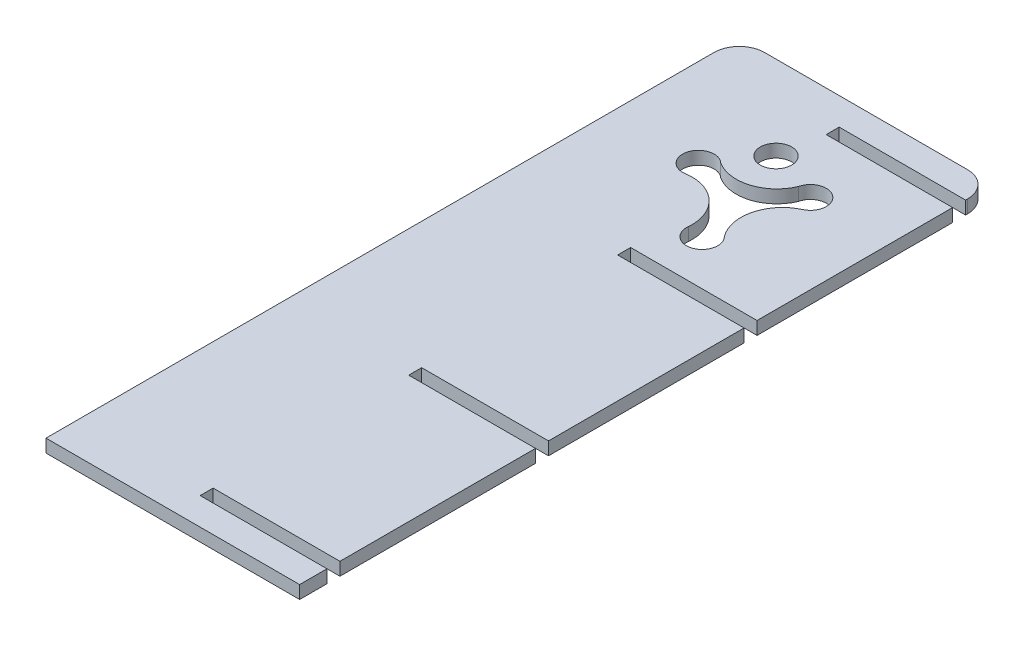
ISO-10303-21;
HEADER;
FILE_DESCRIPTION(('STEP AP214'),'2;1');
FILE_NAME('part.step','',(''),(''),'','','');
FILE_SCHEMA(('AUTOMOTIVE_DESIGN { 1 0 10303 214 1 1 1 1 }'));
ENDSEC;
DATA;
#1=APPLICATION_CONTEXT('core data for automotive mechanical design processes');
#2=APPLICATION_PROTOCOL_DEFINITION('international standard','automotive_design',2000,#1);
#3=PRODUCT_CONTEXT('',#1,'mechanical');
#4=PRODUCT('Part','Part','',(#3));
#5=PRODUCT_RELATED_PRODUCT_CATEGORY('part','',(#4));
#6=PRODUCT_DEFINITION_FORMATION('','',#4);
#7=PRODUCT_DEFINITION_CONTEXT('part definition',#1,'design');
#8=PRODUCT_DEFINITION('design','',#6,#7);
#9=PRODUCT_DEFINITION_SHAPE('','',#8);
#10=(LENGTH_UNIT() NAMED_UNIT(*) SI_UNIT(.MILLI.,.METRE.));
#11=(NAMED_UNIT(*) PLANE_ANGLE_UNIT() SI_UNIT($,.RADIAN.));
#12=(NAMED_UNIT(*) SI_UNIT($,.STERADIAN.) SOLID_ANGLE_UNIT());
#13=UNCERTAINTY_MEASURE_WITH_UNIT(LENGTH_MEASURE(1.E-05),#10,'distance_accuracy_value','');
#14=(GEOMETRIC_REPRESENTATION_CONTEXT(3) GLOBAL_UNCERTAINTY_ASSIGNED_CONTEXT((#13)) GLOBAL_UNIT_ASSIGNED_CONTEXT((#10,
#11,#12)) REPRESENTATION_CONTEXT('',''));
#15=CARTESIAN_POINT('',(0.,0.,0.));
#16=DIRECTION('',(0.,0.,1.));
#17=DIRECTION('',(1.,0.,0.));
#18=AXIS2_PLACEMENT_3D('',#15,#16,#17);
#19=CARTESIAN_POINT('',(0.,23.,-799.229373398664));
#20=DIRECTION('',(0.,0.,1.));
#21=DIRECTION('',(1.,0.,0.));
#22=AXIS2_PLACEMENT_3D('',#19,#20,#21);
#23=PLANE('',#22);
#24=DIRECTION('',(-1.,0.,0.));
#25=VECTOR('',#24,1.);
#26=CARTESIAN_POINT('',(0.,0.,-799.229373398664));
#27=LINE('',#26,#25);
#28=CARTESIAN_POINT('',(348.013954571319,0.,-799.229373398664));
#29=VERTEX_POINT('',#28);
#30=CARTESIAN_POINT('',(-11.986045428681,0.,-799.229373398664));
#31=VERTEX_POINT('',#30);
#32=EDGE_CURVE('E275',#29,#31,#27,.T.);
#33=ORIENTED_EDGE('',*,*,#32,.T.);
#34=DIRECTION('',(0.,-1.,0.));
#35=VECTOR('',#34,1.);
#36=CARTESIAN_POINT('',(-11.986045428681,23.,-799.229373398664));
#37=LINE('',#36,#35);
#38=CARTESIAN_POINT('',(-11.986045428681,23.,-799.229373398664));
#39=VERTEX_POINT('',#38);
#40=EDGE_CURVE('E11',#39,#31,#37,.T.);
#41=ORIENTED_EDGE('',*,*,#40,.F.);
#42=DIRECTION('',(-1.,0.,0.));
#43=VECTOR('',#42,1.);
#44=CARTESIAN_POINT('',(0.,23.,-799.229373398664));
#45=LINE('',#44,#43);
#46=CARTESIAN_POINT('',(348.013954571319,23.,-799.229373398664));
#47=VERTEX_POINT('',#46);
#48=EDGE_CURVE('E417',#47,#39,#45,.T.);
#49=ORIENTED_EDGE('',*,*,#48,.F.);
#50=DIRECTION('',(0.,-1.,0.));
#51=VECTOR('',#50,1.);
#52=CARTESIAN_POINT('',(348.013954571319,23.,-799.229373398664));
#53=LINE('',#52,#51);
#54=EDGE_CURVE('E318',#47,#29,#53,.T.);
#55=ORIENTED_EDGE('',*,*,#54,.T.);
#56=EDGE_LOOP('',(#33,#41,#49,#55));
#57=FACE_BOUND('',#56,.T.);
#58=ADVANCED_FACE('F34',(#57),#23,.F.);
#59=CARTESIAN_POINT('',(-11.9860454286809,23.,-754.229373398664));
#60=DIRECTION('',(0.,-1.,0.));
#61=DIRECTION('',(0.,0.,-1.));
#62=AXIS2_PLACEMENT_3D('',#59,#60,#61);
#63=CYLINDRICAL_SURFACE('',#62,44.9999999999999);
#64=CARTESIAN_POINT('',(-11.9860454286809,0.,-754.229373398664));
#65=DIRECTION('',(0.,1.,0.));
#66=DIRECTION('',(0.,0.,1.));
#67=AXIS2_PLACEMENT_3D('',#64,#65,#66);
#68=CIRCLE('',#67,44.9999999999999);
#69=CARTESIAN_POINT('',(-56.986045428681,0.,-754.229373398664));
#70=VERTEX_POINT('',#69);
#71=EDGE_CURVE('E278',#31,#70,#68,.T.);
#72=ORIENTED_EDGE('',*,*,#71,.T.);
#73=DIRECTION('',(0.,-1.,0.));
#74=VECTOR('',#73,1.);
#75=CARTESIAN_POINT('',(-56.986045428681,23.,-754.229373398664));
#76=LINE('',#75,#74);
#77=CARTESIAN_POINT('',(-56.986045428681,23.,-754.229373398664));
#78=VERTEX_POINT('',#77);
#79=EDGE_CURVE('E44',#78,#70,#76,.T.);
#80=ORIENTED_EDGE('',*,*,#79,.F.);
#81=CARTESIAN_POINT('',(-11.9860454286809,23.,-754.229373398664));
#82=DIRECTION('',(0.,1.,0.));
#83=DIRECTION('',(0.,0.,1.));
#84=AXIS2_PLACEMENT_3D('',#81,#82,#83);
#85=CIRCLE('',#84,44.9999999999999);
#86=EDGE_CURVE('E419',#39,#78,#85,.T.);
#87=ORIENTED_EDGE('',*,*,#86,.F.);
#88=ORIENTED_EDGE('',*,*,#40,.T.);
#89=EDGE_LOOP('',(#72,#80,#87,#88));
#90=FACE_BOUND('',#89,.T.);
#91=ADVANCED_FACE('F483',(#90),#63,.T.);
#92=CARTESIAN_POINT('',(-56.9860454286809,23.,0.));
#93=DIRECTION('',(1.,0.,0.));
#94=DIRECTION('',(0.,0.,-1.));
#95=AXIS2_PLACEMENT_3D('',#92,#93,#94);
#96=PLANE('',#95);
#97=DIRECTION('',(0.,0.,1.));
#98=VECTOR('',#97,1.);
#99=CARTESIAN_POINT('',(-56.9860454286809,0.,0.));
#100=LINE('',#99,#98);
#101=CARTESIAN_POINT('',(-56.9860454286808,0.,430.770626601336));
#102=VERTEX_POINT('',#101);
#103=EDGE_CURVE('E280',#70,#102,#100,.T.);
#104=ORIENTED_EDGE('',*,*,#103,.T.);
#105=DIRECTION('',(0.,-1.,0.));
#106=VECTOR('',#105,1.);
#107=CARTESIAN_POINT('',(-56.9860454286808,23.,430.770626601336));
#108=LINE('',#107,#106);
#109=CARTESIAN_POINT('',(-56.9860454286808,23.,430.770626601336));
#110=VERTEX_POINT('',#109);
#111=EDGE_CURVE('E367',#110,#102,#108,.T.);
#112=ORIENTED_EDGE('',*,*,#111,.F.);
#113=DIRECTION('',(0.,0.,1.));
#114=VECTOR('',#113,1.);
#115=CARTESIAN_POINT('',(-56.9860454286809,23.,0.));
#116=LINE('',#115,#114);
#117=EDGE_CURVE('E421',#78,#110,#116,.T.);
#118=ORIENTED_EDGE('',*,*,#117,.F.);
#119=ORIENTED_EDGE('',*,*,#79,.T.);
#120=EDGE_LOOP('',(#104,#112,#118,#119));
#121=FACE_BOUND('',#120,.T.);
#122=ADVANCED_FACE('F488',(#121),#96,.F.);
#123=CARTESIAN_POINT('',(0.,23.,430.770626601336));
#124=DIRECTION('',(0.,0.,-1.));
#125=DIRECTION('',(-1.,0.,0.));
#126=AXIS2_PLACEMENT_3D('',#123,#124,#125);
#127=PLANE('',#126);
#128=DIRECTION('',(1.,0.,0.));
#129=VECTOR('',#128,1.);
#130=CARTESIAN_POINT('',(0.,0.,430.770626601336));
#131=LINE('',#130,#129);
#132=CARTESIAN_POINT('',(393.013954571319,0.,430.770626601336));
#133=VERTEX_POINT('',#132);
#134=EDGE_CURVE('E282',#102,#133,#131,.T.);
#135=ORIENTED_EDGE('',*,*,#134,.T.);
#136=DIRECTION('',(0.,-1.,0.));
#137=VECTOR('',#136,1.);
#138=CARTESIAN_POINT('',(393.013954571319,23.,430.770626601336));
#139=LINE('',#138,#137);
#140=CARTESIAN_POINT('',(393.013954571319,23.,430.770626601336));
#141=VERTEX_POINT('',#140);
#142=EDGE_CURVE('E364',#141,#133,#139,.T.);
#143=ORIENTED_EDGE('',*,*,#142,.F.);
#144=DIRECTION('',(1.,0.,0.));
#145=VECTOR('',#144,1.);
#146=CARTESIAN_POINT('',(0.,23.,430.770626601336));
#147=LINE('',#146,#145);
#148=EDGE_CURVE('E423',#110,#141,#147,.T.);
#149=ORIENTED_EDGE('',*,*,#148,.F.);
#150=ORIENTED_EDGE('',*,*,#111,.T.);
#151=EDGE_LOOP('',(#135,#143,#149,#150));
#152=FACE_BOUND('',#151,.T.);
#153=ADVANCED_FACE('F570',(#152),#127,.F.);
#154=CARTESIAN_POINT('',(393.013954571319,23.,0.));
#155=DIRECTION('',(-1.,0.,0.));
#156=DIRECTION('',(0.,0.,1.));
#157=AXIS2_PLACEMENT_3D('',#154,#155,#156);
#158=PLANE('',#157);
#159=DIRECTION('',(0.,0.,-1.));
#160=VECTOR('',#159,1.);
#161=CARTESIAN_POINT('',(393.013954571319,0.,0.));
#162=LINE('',#161,#160);
#163=CARTESIAN_POINT('',(393.013954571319,0.,382.270626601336));
#164=VERTEX_POINT('',#163);
#165=EDGE_CURVE('E284',#133,#164,#162,.T.);
#166=ORIENTED_EDGE('',*,*,#165,.T.);
#167=DIRECTION('',(0.,-1.,0.));
#168=VECTOR('',#167,1.);
#169=CARTESIAN_POINT('',(393.013954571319,23.,382.270626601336));
#170=LINE('',#169,#168);
#171=CARTESIAN_POINT('',(393.013954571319,23.,382.270626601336));
#172=VERTEX_POINT('',#171);
#173=EDGE_CURVE('E361',#172,#164,#170,.T.);
#174=ORIENTED_EDGE('',*,*,#173,.F.);
#175=DIRECTION('',(0.,0.,-1.));
#176=VECTOR('',#175,1.);
#177=CARTESIAN_POINT('',(393.013954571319,23.,0.));
#178=LINE('',#177,#176);
#179=EDGE_CURVE('E425',#141,#172,#178,.T.);
#180=ORIENTED_EDGE('',*,*,#179,.F.);
#181=ORIENTED_EDGE('',*,*,#142,.T.);
#182=EDGE_LOOP('',(#166,#174,#180,#181));
#183=FACE_BOUND('',#182,.T.);
#184=ADVANCED_FACE('F566',(#183),#158,.F.);
#185=CARTESIAN_POINT('',(0.,23.,382.270626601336));
#186=DIRECTION('',(0.,0.,1.));
#187=DIRECTION('',(1.,0.,0.));
#188=AXIS2_PLACEMENT_3D('',#185,#186,#187);
#189=PLANE('',#188);
#190=DIRECTION('',(-1.,0.,0.));
#191=VECTOR('',#190,1.);
#192=CARTESIAN_POINT('',(0.,0.,382.270626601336));
#193=LINE('',#192,#191);
#194=CARTESIAN_POINT('',(168.013954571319,0.,382.270626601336));
#195=VERTEX_POINT('',#194);
#196=EDGE_CURVE('E286',#164,#195,#193,.T.);
#197=ORIENTED_EDGE('',*,*,#196,.T.);
#198=DIRECTION('',(0.,-1.,0.));
#199=VECTOR('',#198,1.);
#200=CARTESIAN_POINT('',(168.013954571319,23.,382.270626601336));
#201=LINE('',#200,#199);
#202=CARTESIAN_POINT('',(168.013954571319,23.,382.270626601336));
#203=VERTEX_POINT('',#202);
#204=EDGE_CURVE('E358',#203,#195,#201,.T.);
#205=ORIENTED_EDGE('',*,*,#204,.F.);
#206=DIRECTION('',(-1.,0.,0.));
#207=VECTOR('',#206,1.);
#208=CARTESIAN_POINT('',(0.,23.,382.270626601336));
#209=LINE('',#208,#207);
#210=EDGE_CURVE('E427',#172,#203,#209,.T.);
#211=ORIENTED_EDGE('',*,*,#210,.F.);
#212=ORIENTED_EDGE('',*,*,#173,.T.);
#213=EDGE_LOOP('',(#197,#205,#211,#212));
#214=FACE_BOUND('',#213,.T.);
#215=ADVANCED_FACE('F562',(#214),#189,.F.);
#216=CARTESIAN_POINT('',(168.013954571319,23.,0.));
#217=DIRECTION('',(-1.,0.,0.));
#218=DIRECTION('',(0.,0.,1.));
#219=AXIS2_PLACEMENT_3D('',#216,#217,#218);
#220=PLANE('',#219);
#221=DIRECTION('',(0.,0.,-1.));
#222=VECTOR('',#221,1.);
#223=CARTESIAN_POINT('',(168.013954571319,0.,0.));
#224=LINE('',#223,#222);
#225=CARTESIAN_POINT('',(168.013954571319,0.,359.270626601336));
#226=VERTEX_POINT('',#225);
#227=EDGE_CURVE('E288',#195,#226,#224,.T.);
#228=ORIENTED_EDGE('',*,*,#227,.T.);
#229=DIRECTION('',(0.,-1.,0.));
#230=VECTOR('',#229,1.);
#231=CARTESIAN_POINT('',(168.013954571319,23.,359.270626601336));
#232=LINE('',#231,#230);
#233=CARTESIAN_POINT('',(168.013954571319,23.,359.270626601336));
#234=VERTEX_POINT('',#233);
#235=EDGE_CURVE('E355',#234,#226,#232,.T.);
#236=ORIENTED_EDGE('',*,*,#235,.F.);
#237=DIRECTION('',(0.,0.,-1.));
#238=VECTOR('',#237,1.);
#239=CARTESIAN_POINT('',(168.013954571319,23.,0.));
#240=LINE('',#239,#238);
#241=EDGE_CURVE('E429',#203,#234,#240,.T.);
#242=ORIENTED_EDGE('',*,*,#241,.F.);
#243=ORIENTED_EDGE('',*,*,#204,.T.);
#244=EDGE_LOOP('',(#228,#236,#242,#243));
#245=FACE_BOUND('',#244,.T.);
#246=ADVANCED_FACE('F558',(#245),#220,.F.);
#247=CARTESIAN_POINT('',(0.,23.,359.270626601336));
#248=DIRECTION('',(0.,0.,-1.));
#249=DIRECTION('',(-1.,0.,0.));
#250=AXIS2_PLACEMENT_3D('',#247,#248,#249);
#251=PLANE('',#250);
#252=DIRECTION('',(1.,0.,0.));
#253=VECTOR('',#252,1.);
#254=CARTESIAN_POINT('',(0.,0.,359.270626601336));
#255=LINE('',#254,#253);
#256=CARTESIAN_POINT('',(393.013954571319,0.,359.270626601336));
#257=VERTEX_POINT('',#256);
#258=EDGE_CURVE('E290',#226,#257,#255,.T.);
#259=ORIENTED_EDGE('',*,*,#258,.T.);
#260=DIRECTION('',(0.,-1.,0.));
#261=VECTOR('',#260,1.);
#262=CARTESIAN_POINT('',(393.013954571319,23.,359.270626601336));
#263=LINE('',#262,#261);
#264=CARTESIAN_POINT('',(393.013954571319,23.,359.270626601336));
#265=VERTEX_POINT('',#264);
#266=EDGE_CURVE('E352',#265,#257,#263,.T.);
#267=ORIENTED_EDGE('',*,*,#266,.F.);
#268=DIRECTION('',(1.,0.,0.));
#269=VECTOR('',#268,1.);
#270=CARTESIAN_POINT('',(0.,23.,359.270626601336));
#271=LINE('',#270,#269);
#272=EDGE_CURVE('E431',#234,#265,#271,.T.);
#273=ORIENTED_EDGE('',*,*,#272,.F.);
#274=ORIENTED_EDGE('',*,*,#235,.T.);
#275=EDGE_LOOP('',(#259,#267,#273,#274));
#276=FACE_BOUND('',#275,.T.);
#277=ADVANCED_FACE('F554',(#276),#251,.F.);
#278=CARTESIAN_POINT('',(393.013954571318,23.,-9.43083158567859E-13));
#279=DIRECTION('',(-1.,0.,0.));
#280=DIRECTION('',(0.,0.,1.));
#281=AXIS2_PLACEMENT_3D('',#278,#279,#280);
#282=PLANE('',#281);
#283=DIRECTION('',(0.,0.,-1.));
#284=VECTOR('',#283,1.);
#285=CARTESIAN_POINT('',(393.013954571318,0.,-9.43083158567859E-13));
#286=LINE('',#285,#284);
#287=CARTESIAN_POINT('',(393.013954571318,0.,12.2706266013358));
#288=VERTEX_POINT('',#287);
#289=EDGE_CURVE('E292',#257,#288,#286,.T.);
#290=ORIENTED_EDGE('',*,*,#289,.T.);
#291=DIRECTION('',(0.,-1.,0.));
#292=VECTOR('',#291,1.);
#293=CARTESIAN_POINT('',(393.013954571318,23.,12.2706266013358));
#294=LINE('',#293,#292);
#295=CARTESIAN_POINT('',(393.013954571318,23.,12.2706266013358));
#296=VERTEX_POINT('',#295);
#297=EDGE_CURVE('E349',#296,#288,#294,.T.);
#298=ORIENTED_EDGE('',*,*,#297,.F.);
#299=DIRECTION('',(0.,0.,-1.));
#300=VECTOR('',#299,1.);
#301=CARTESIAN_POINT('',(393.013954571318,23.,-9.43083158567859E-13));
#302=LINE('',#301,#300);
#303=EDGE_CURVE('E433',#265,#296,#302,.T.);
#304=ORIENTED_EDGE('',*,*,#303,.F.);
#305=ORIENTED_EDGE('',*,*,#266,.T.);
#306=EDGE_LOOP('',(#290,#298,#304,#305));
#307=FACE_BOUND('',#306,.T.);
#308=ADVANCED_FACE('F550',(#307),#282,.F.);
#309=CARTESIAN_POINT('',(0.,23.,12.2706266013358));
#310=DIRECTION('',(0.,0.,1.));
#311=DIRECTION('',(1.,0.,0.));
#312=AXIS2_PLACEMENT_3D('',#309,#310,#311);
#313=PLANE('',#312);
#314=DIRECTION('',(-1.,0.,0.));
#315=VECTOR('',#314,1.);
#316=CARTESIAN_POINT('',(0.,0.,12.2706266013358));
#317=LINE('',#316,#315);
#318=CARTESIAN_POINT('',(168.013954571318,0.,12.2706266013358));
#319=VERTEX_POINT('',#318);
#320=EDGE_CURVE('E294',#288,#319,#317,.T.);
#321=ORIENTED_EDGE('',*,*,#320,.T.);
#322=DIRECTION('',(0.,-1.,0.));
#323=VECTOR('',#322,1.);
#324=CARTESIAN_POINT('',(168.013954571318,23.,12.2706266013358));
#325=LINE('',#324,#323);
#326=CARTESIAN_POINT('',(168.013954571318,23.,12.2706266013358));
#327=VERTEX_POINT('',#326);
#328=EDGE_CURVE('E346',#327,#319,#325,.T.);
#329=ORIENTED_EDGE('',*,*,#328,.F.);
#330=DIRECTION('',(-1.,0.,0.));
#331=VECTOR('',#330,1.);
#332=CARTESIAN_POINT('',(0.,23.,12.2706266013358));
#333=LINE('',#332,#331);
#334=EDGE_CURVE('E435',#296,#327,#333,.T.);
#335=ORIENTED_EDGE('',*,*,#334,.F.);
#336=ORIENTED_EDGE('',*,*,#297,.T.);
#337=EDGE_LOOP('',(#321,#329,#335,#336));
#338=FACE_BOUND('',#337,.T.);
#339=ADVANCED_FACE('F546',(#338),#313,.F.);
#340=CARTESIAN_POINT('',(168.013954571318,23.,0.));
#341=DIRECTION('',(-1.,0.,0.));
#342=DIRECTION('',(0.,0.,1.));
#343=AXIS2_PLACEMENT_3D('',#340,#341,#342);
#344=PLANE('',#343);
#345=DIRECTION('',(0.,0.,-1.));
#346=VECTOR('',#345,1.);
#347=CARTESIAN_POINT('',(168.013954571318,0.,0.));
#348=LINE('',#347,#346);
#349=CARTESIAN_POINT('',(168.013954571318,0.,-10.7293733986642));
#350=VERTEX_POINT('',#349);
#351=EDGE_CURVE('E296',#319,#350,#348,.T.);
#352=ORIENTED_EDGE('',*,*,#351,.T.);
#353=DIRECTION('',(0.,-1.,0.));
#354=VECTOR('',#353,1.);
#355=CARTESIAN_POINT('',(168.013954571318,23.,-10.7293733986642));
#356=LINE('',#355,#354);
#357=CARTESIAN_POINT('',(168.013954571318,23.,-10.7293733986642));
#358=VERTEX_POINT('',#357);
#359=EDGE_CURVE('E343',#358,#350,#356,.T.);
#360=ORIENTED_EDGE('',*,*,#359,.F.);
#361=DIRECTION('',(0.,0.,-1.));
#362=VECTOR('',#361,1.);
#363=CARTESIAN_POINT('',(168.013954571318,23.,0.));
#364=LINE('',#363,#362);
#365=EDGE_CURVE('E437',#327,#358,#364,.T.);
#366=ORIENTED_EDGE('',*,*,#365,.F.);
#367=ORIENTED_EDGE('',*,*,#328,.T.);
#368=EDGE_LOOP('',(#352,#360,#366,#367));
#369=FACE_BOUND('',#368,.T.);
#370=ADVANCED_FACE('F542',(#369),#344,.F.);
#371=CARTESIAN_POINT('',(0.,23.,-10.7293733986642));
#372=DIRECTION('',(0.,0.,-1.));
#373=DIRECTION('',(-1.,0.,0.));
#374=AXIS2_PLACEMENT_3D('',#371,#372,#373);
#375=PLANE('',#374);
#376=DIRECTION('',(1.,0.,0.));
#377=VECTOR('',#376,1.);
#378=CARTESIAN_POINT('',(0.,0.,-10.7293733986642));
#379=LINE('',#378,#377);
#380=CARTESIAN_POINT('',(393.013954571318,0.,-10.7293733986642));
#381=VERTEX_POINT('',#380);
#382=EDGE_CURVE('E298',#350,#381,#379,.T.);
#383=ORIENTED_EDGE('',*,*,#382,.T.);
#384=DIRECTION('',(0.,-1.,0.));
#385=VECTOR('',#384,1.);
#386=CARTESIAN_POINT('',(393.013954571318,23.,-10.7293733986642));
#387=LINE('',#386,#385);
#388=CARTESIAN_POINT('',(393.013954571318,23.,-10.7293733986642));
#389=VERTEX_POINT('',#388);
#390=EDGE_CURVE('E340',#389,#381,#387,.T.);
#391=ORIENTED_EDGE('',*,*,#390,.F.);
#392=DIRECTION('',(1.,0.,0.));
#393=VECTOR('',#392,1.);
#394=CARTESIAN_POINT('',(0.,23.,-10.7293733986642));
#395=LINE('',#394,#393);
#396=EDGE_CURVE('E439',#358,#389,#395,.T.);
#397=ORIENTED_EDGE('',*,*,#396,.F.);
#398=ORIENTED_EDGE('',*,*,#359,.T.);
#399=EDGE_LOOP('',(#383,#391,#397,#398));
#400=FACE_BOUND('',#399,.T.);
#401=ADVANCED_FACE('F538',(#400),#375,.F.);
#402=CARTESIAN_POINT('',(393.013954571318,23.,-9.4308315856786E-13));
#403=DIRECTION('',(-1.,0.,0.));
#404=DIRECTION('',(0.,0.,1.));
#405=AXIS2_PLACEMENT_3D('',#402,#403,#404);
#406=PLANE('',#405);
#407=DIRECTION('',(0.,0.,-1.));
#408=VECTOR('',#407,1.);
#409=CARTESIAN_POINT('',(393.013954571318,0.,-9.4308315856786E-13));
#410=LINE('',#409,#408);
#411=CARTESIAN_POINT('',(393.013954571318,0.,-357.729373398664));
#412=VERTEX_POINT('',#411);
#413=EDGE_CURVE('E300',#381,#412,#410,.T.);
#414=ORIENTED_EDGE('',*,*,#413,.T.);
#415=DIRECTION('',(0.,-1.,0.));
#416=VECTOR('',#415,1.);
#417=CARTESIAN_POINT('',(393.013954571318,23.,-357.729373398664));
#418=LINE('',#417,#416);
#419=CARTESIAN_POINT('',(393.013954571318,23.,-357.729373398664));
#420=VERTEX_POINT('',#419);
#421=EDGE_CURVE('E337',#420,#412,#418,.T.);
#422=ORIENTED_EDGE('',*,*,#421,.F.);
#423=DIRECTION('',(0.,0.,-1.));
#424=VECTOR('',#423,1.);
#425=CARTESIAN_POINT('',(393.013954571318,23.,-9.4308315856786E-13));
#426=LINE('',#425,#424);
#427=EDGE_CURVE('E441',#389,#420,#426,.T.);
#428=ORIENTED_EDGE('',*,*,#427,.F.);
#429=ORIENTED_EDGE('',*,*,#390,.T.);
#430=EDGE_LOOP('',(#414,#422,#428,#429));
#431=FACE_BOUND('',#430,.T.);
#432=ADVANCED_FACE('F534',(#431),#406,.F.);
#433=CARTESIAN_POINT('',(0.,23.,-357.729373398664));
#434=DIRECTION('',(0.,0.,1.));
#435=DIRECTION('',(1.,0.,0.));
#436=AXIS2_PLACEMENT_3D('',#433,#434,#435);
#437=PLANE('',#436);
#438=DIRECTION('',(-1.,0.,0.));
#439=VECTOR('',#438,1.);
#440=CARTESIAN_POINT('',(0.,0.,-357.729373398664));
#441=LINE('',#440,#439);
#442=CARTESIAN_POINT('',(168.71643871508,0.,-357.729373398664));
#443=VERTEX_POINT('',#442);
#444=EDGE_CURVE('E302',#412,#443,#441,.T.);
#445=ORIENTED_EDGE('',*,*,#444,.T.);
#446=DIRECTION('',(0.,-1.,0.));
#447=VECTOR('',#446,1.);
#448=CARTESIAN_POINT('',(168.71643871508,23.,-357.729373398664));
#449=LINE('',#448,#447);
#450=CARTESIAN_POINT('',(168.71643871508,23.,-357.729373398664));
#451=VERTEX_POINT('',#450);
#452=EDGE_CURVE('E334',#451,#443,#449,.T.);
#453=ORIENTED_EDGE('',*,*,#452,.F.);
#454=DIRECTION('',(-1.,0.,0.));
#455=VECTOR('',#454,1.);
#456=CARTESIAN_POINT('',(0.,23.,-357.729373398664));
#457=LINE('',#456,#455);
#458=EDGE_CURVE('E443',#420,#451,#457,.T.);
#459=ORIENTED_EDGE('',*,*,#458,.F.);
#460=ORIENTED_EDGE('',*,*,#421,.T.);
#461=EDGE_LOOP('',(#445,#453,#459,#460));
#462=FACE_BOUND('',#461,.T.);
#463=ADVANCED_FACE('F530',(#462),#437,.F.);
#464=CARTESIAN_POINT('',(168.716438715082,23.,-1.01800475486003E-12));
#465=DIRECTION('',(-1.,0.,0.));
#466=DIRECTION('',(0.,0.,1.));
#467=AXIS2_PLACEMENT_3D('',#464,#465,#466);
#468=PLANE('',#467);
#469=DIRECTION('',(0.,0.,-1.));
#470=VECTOR('',#469,1.);
#471=CARTESIAN_POINT('',(168.716438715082,0.,-1.01800475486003E-12));
#472=LINE('',#471,#470);
#473=CARTESIAN_POINT('',(168.71643871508,0.,-380.729373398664));
#474=VERTEX_POINT('',#473);
#475=EDGE_CURVE('E304',#443,#474,#472,.T.);
#476=ORIENTED_EDGE('',*,*,#475,.T.);
#477=DIRECTION('',(0.,-1.,0.));
#478=VECTOR('',#477,1.);
#479=CARTESIAN_POINT('',(168.71643871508,23.,-380.729373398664));
#480=LINE('',#479,#478);
#481=CARTESIAN_POINT('',(168.71643871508,23.,-380.729373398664));
#482=VERTEX_POINT('',#481);
#483=EDGE_CURVE('E331',#482,#474,#480,.T.);
#484=ORIENTED_EDGE('',*,*,#483,.F.);
#485=DIRECTION('',(0.,0.,-1.));
#486=VECTOR('',#485,1.);
#487=CARTESIAN_POINT('',(168.716438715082,23.,-1.01800475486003E-12));
#488=LINE('',#487,#486);
#489=EDGE_CURVE('E445',#451,#482,#488,.T.);
#490=ORIENTED_EDGE('',*,*,#489,.F.);
#491=ORIENTED_EDGE('',*,*,#452,.T.);
#492=EDGE_LOOP('',(#476,#484,#490,#491));
#493=FACE_BOUND('',#492,.T.);
#494=ADVANCED_FACE('F526',(#493),#468,.F.);
#495=CARTESIAN_POINT('',(0.,23.,-380.729373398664));
#496=DIRECTION('',(0.,0.,-1.));
#497=DIRECTION('',(-1.,0.,0.));
#498=AXIS2_PLACEMENT_3D('',#495,#496,#497);
#499=PLANE('',#498);
#500=DIRECTION('',(1.,0.,0.));
#501=VECTOR('',#500,1.);
#502=CARTESIAN_POINT('',(0.,0.,-380.729373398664));
#503=LINE('',#502,#501);
#504=CARTESIAN_POINT('',(393.013954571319,0.,-380.729373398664));
#505=VERTEX_POINT('',#504);
#506=EDGE_CURVE('E306',#474,#505,#503,.T.);
#507=ORIENTED_EDGE('',*,*,#506,.T.);
#508=DIRECTION('',(0.,-1.,0.));
#509=VECTOR('',#508,1.);
#510=CARTESIAN_POINT('',(393.013954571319,23.,-380.729373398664));
#511=LINE('',#510,#509);
#512=CARTESIAN_POINT('',(393.013954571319,23.,-380.729373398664));
#513=VERTEX_POINT('',#512);
#514=EDGE_CURVE('E328',#513,#505,#511,.T.);
#515=ORIENTED_EDGE('',*,*,#514,.F.);
#516=DIRECTION('',(1.,0.,0.));
#517=VECTOR('',#516,1.);
#518=CARTESIAN_POINT('',(0.,23.,-380.729373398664));
#519=LINE('',#518,#517);
#520=EDGE_CURVE('E447',#482,#513,#519,.T.);
#521=ORIENTED_EDGE('',*,*,#520,.F.);
#522=ORIENTED_EDGE('',*,*,#483,.T.);
#523=EDGE_LOOP('',(#507,#515,#521,#522));
#524=FACE_BOUND('',#523,.T.);
#525=ADVANCED_FACE('F522',(#524),#499,.F.);
#526=CARTESIAN_POINT('',(393.013954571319,23.,0.));
#527=DIRECTION('',(-1.,0.,0.));
#528=DIRECTION('',(0.,0.,1.));
#529=AXIS2_PLACEMENT_3D('',#526,#527,#528);
#530=PLANE('',#529);
#531=DIRECTION('',(0.,0.,-1.));
#532=VECTOR('',#531,1.);
#533=CARTESIAN_POINT('',(393.013954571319,0.,0.));
#534=LINE('',#533,#532);
#535=CARTESIAN_POINT('',(393.013954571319,0.,-727.729373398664));
#536=VERTEX_POINT('',#535);
#537=EDGE_CURVE('E308',#505,#536,#534,.T.);
#538=ORIENTED_EDGE('',*,*,#537,.T.);
#539=DIRECTION('',(0.,-1.,0.));
#540=VECTOR('',#539,1.);
#541=CARTESIAN_POINT('',(393.013954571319,23.,-727.729373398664));
#542=LINE('',#541,#540);
#543=CARTESIAN_POINT('',(393.013954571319,23.,-727.729373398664));
#544=VERTEX_POINT('',#543);
#545=EDGE_CURVE('E325',#544,#536,#542,.T.);
#546=ORIENTED_EDGE('',*,*,#545,.F.);
#547=DIRECTION('',(0.,0.,-1.));
#548=VECTOR('',#547,1.);
#549=CARTESIAN_POINT('',(393.013954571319,23.,0.));
#550=LINE('',#549,#548);
#551=EDGE_CURVE('E449',#513,#544,#550,.T.);
#552=ORIENTED_EDGE('',*,*,#551,.F.);
#553=ORIENTED_EDGE('',*,*,#514,.T.);
#554=EDGE_LOOP('',(#538,#546,#552,#553));
#555=FACE_BOUND('',#554,.T.);
#556=ADVANCED_FACE('F519',(#555),#530,.F.);
#557=CARTESIAN_POINT('',(0.,23.,-727.729373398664));
#558=DIRECTION('',(0.,0.,1.));
#559=DIRECTION('',(1.,0.,0.));
#560=AXIS2_PLACEMENT_3D('',#557,#558,#559);
#561=PLANE('',#560);
#562=DIRECTION('',(-1.,0.,0.));
#563=VECTOR('',#562,1.);
#564=CARTESIAN_POINT('',(0.,0.,-727.729373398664));
#565=LINE('',#564,#563);
#566=CARTESIAN_POINT('',(168.716438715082,0.,-727.729373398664));
#567=VERTEX_POINT('',#566);
#568=EDGE_CURVE('E310',#536,#567,#565,.T.);
#569=ORIENTED_EDGE('',*,*,#568,.T.);
#570=DIRECTION('',(0.,-1.,0.));
#571=VECTOR('',#570,1.);
#572=CARTESIAN_POINT('',(168.716438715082,23.,-727.729373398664));
#573=LINE('',#572,#571);
#574=CARTESIAN_POINT('',(168.716438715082,23.,-727.729373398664));
#575=VERTEX_POINT('',#574);
#576=EDGE_CURVE('E322',#575,#567,#573,.T.);
#577=ORIENTED_EDGE('',*,*,#576,.F.);
#578=DIRECTION('',(-1.,0.,0.));
#579=VECTOR('',#578,1.);
#580=CARTESIAN_POINT('',(0.,23.,-727.729373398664));
#581=LINE('',#580,#579);
#582=EDGE_CURVE('E451',#544,#575,#581,.T.);
#583=ORIENTED_EDGE('',*,*,#582,.F.);
#584=ORIENTED_EDGE('',*,*,#545,.T.);
#585=EDGE_LOOP('',(#569,#577,#583,#584));
#586=FACE_BOUND('',#585,.T.);
#587=ADVANCED_FACE('F457',(#586),#561,.F.);
#588=CARTESIAN_POINT('',(168.716438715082,23.,0.));
#589=DIRECTION('',(-1.,0.,0.));
#590=DIRECTION('',(0.,0.,1.));
#591=AXIS2_PLACEMENT_3D('',#588,#589,#590);
#592=PLANE('',#591);
#593=DIRECTION('',(0.,0.,-1.));
#594=VECTOR('',#593,1.);
#595=CARTESIAN_POINT('',(168.716438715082,0.,0.));
#596=LINE('',#595,#594);
#597=CARTESIAN_POINT('',(168.716438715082,0.,-750.729373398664));
#598=VERTEX_POINT('',#597);
#599=EDGE_CURVE('E312',#567,#598,#596,.T.);
#600=ORIENTED_EDGE('',*,*,#599,.T.);
#601=DIRECTION('',(0.,-1.,0.));
#602=VECTOR('',#601,1.);
#603=CARTESIAN_POINT('',(168.716438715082,23.,-750.729373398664));
#604=LINE('',#603,#602);
#605=CARTESIAN_POINT('',(168.716438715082,23.,-750.729373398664));
#606=VERTEX_POINT('',#605);
#607=EDGE_CURVE('E245',#606,#598,#604,.T.);
#608=ORIENTED_EDGE('',*,*,#607,.F.);
#609=DIRECTION('',(0.,0.,-1.));
#610=VECTOR('',#609,1.);
#611=CARTESIAN_POINT('',(168.716438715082,23.,0.));
#612=LINE('',#611,#610);
#613=EDGE_CURVE('E236',#575,#606,#612,.T.);
#614=ORIENTED_EDGE('',*,*,#613,.F.);
#615=ORIENTED_EDGE('',*,*,#576,.T.);
#616=EDGE_LOOP('',(#600,#608,#614,#615));
#617=FACE_BOUND('',#616,.T.);
#618=ADVANCED_FACE('F461',(#617),#592,.F.);
#619=CARTESIAN_POINT('',(0.,23.,-750.729373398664));
#620=DIRECTION('',(0.,0.,-1.));
#621=DIRECTION('',(-1.,0.,0.));
#622=AXIS2_PLACEMENT_3D('',#619,#620,#621);
#623=PLANE('',#622);
#624=DIRECTION('',(1.,0.,0.));
#625=VECTOR('',#624,1.);
#626=CARTESIAN_POINT('',(0.,0.,-750.729373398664));
#627=LINE('',#626,#625);
#628=CARTESIAN_POINT('',(393.013954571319,0.,-750.729373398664));
#629=VERTEX_POINT('',#628);
#630=EDGE_CURVE('E244',#598,#629,#627,.T.);
#631=ORIENTED_EDGE('',*,*,#630,.T.);
#632=DIRECTION('',(0.,-1.,0.));
#633=VECTOR('',#632,1.);
#634=CARTESIAN_POINT('',(393.013954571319,23.,-750.729373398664));
#635=LINE('',#634,#633);
#636=CARTESIAN_POINT('',(393.013954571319,23.,-750.729373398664));
#637=VERTEX_POINT('',#636);
#638=EDGE_CURVE('E241',#637,#629,#635,.T.);
#639=ORIENTED_EDGE('',*,*,#638,.F.);
#640=DIRECTION('',(1.,0.,0.));
#641=VECTOR('',#640,1.);
#642=CARTESIAN_POINT('',(0.,23.,-750.729373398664));
#643=LINE('',#642,#641);
#644=EDGE_CURVE('E230',#606,#637,#643,.T.);
#645=ORIENTED_EDGE('',*,*,#644,.F.);
#646=ORIENTED_EDGE('',*,*,#607,.T.);
#647=EDGE_LOOP('',(#631,#639,#645,#646));
#648=FACE_BOUND('',#647,.T.);
#649=ADVANCED_FACE('F242',(#648),#623,.F.);
#650=CARTESIAN_POINT('',(393.013954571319,23.,0.));
#651=DIRECTION('',(-1.,0.,0.));
#652=DIRECTION('',(0.,0.,1.));
#653=AXIS2_PLACEMENT_3D('',#650,#651,#652);
#654=PLANE('',#653);
#655=DIRECTION('',(0.,0.,-1.));
#656=VECTOR('',#655,1.);
#657=CARTESIAN_POINT('',(393.013954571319,0.,0.));
#658=LINE('',#657,#656);
#659=CARTESIAN_POINT('',(393.013954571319,0.,-754.229373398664));
#660=VERTEX_POINT('',#659);
#661=EDGE_CURVE('E142',#629,#660,#658,.T.);
#662=ORIENTED_EDGE('',*,*,#661,.T.);
#663=DIRECTION('',(0.,-1.,0.));
#664=VECTOR('',#663,1.);
#665=CARTESIAN_POINT('',(393.013954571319,23.,-754.229373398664));
#666=LINE('',#665,#664);
#667=CARTESIAN_POINT('',(393.013954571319,23.,-754.229373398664));
#668=VERTEX_POINT('',#667);
#669=EDGE_CURVE('E246',#668,#660,#666,.T.);
#670=ORIENTED_EDGE('',*,*,#669,.F.);
#671=DIRECTION('',(0.,0.,-1.));
#672=VECTOR('',#671,1.);
#673=CARTESIAN_POINT('',(393.013954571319,23.,0.));
#674=LINE('',#673,#672);
#675=EDGE_CURVE('E234',#637,#668,#674,.T.);
#676=ORIENTED_EDGE('',*,*,#675,.F.);
#677=ORIENTED_EDGE('',*,*,#638,.T.);
#678=EDGE_LOOP('',(#662,#670,#676,#677));
#679=FACE_BOUND('',#678,.T.);
#680=ADVANCED_FACE('F248',(#679),#654,.F.);
#681=CARTESIAN_POINT('',(157.52531333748,23.,-651.273956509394));
#682=DIRECTION('',(0.,-1.,0.));
#683=DIRECTION('',(0.,0.,-1.));
#684=AXIS2_PLACEMENT_3D('',#681,#682,#683);
#685=CYLINDRICAL_SURFACE('',#684,72.0018704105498);
#686=CARTESIAN_POINT('',(157.52531333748,0.,-651.273956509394));
#687=DIRECTION('',(0.,1.,0.));
#688=DIRECTION('',(0.,0.,1.));
#689=AXIS2_PLACEMENT_3D('',#686,#687,#688);
#690=CIRCLE('',#689,72.0018704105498);
#691=CARTESIAN_POINT('',(223.842994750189,0.,-623.234083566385));
#692=VERTEX_POINT('',#691);
#693=CARTESIAN_POINT('',(118.756659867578,0.,-590.600561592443));
#694=VERTEX_POINT('',#693);
#695=EDGE_CURVE('E254',#692,#694,#690,.F.);
#696=ORIENTED_EDGE('',*,*,#695,.F.);
#697=DIRECTION('',(0.,-1.,0.));
#698=VECTOR('',#697,1.);
#699=CARTESIAN_POINT('',(223.842994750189,23.,-623.234083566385));
#700=LINE('',#699,#698);
#701=CARTESIAN_POINT('',(223.842994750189,23.,-623.234083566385));
#702=VERTEX_POINT('',#701);
#703=EDGE_CURVE('E38',#702,#692,#700,.T.);
#704=ORIENTED_EDGE('',*,*,#703,.F.);
#705=CARTESIAN_POINT('',(157.52531333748,23.,-651.273956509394));
#706=DIRECTION('',(0.,1.,0.));
#707=DIRECTION('',(0.,0.,1.));
#708=AXIS2_PLACEMENT_3D('',#705,#706,#707);
#709=CIRCLE('',#708,72.0018704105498);
#710=CARTESIAN_POINT('',(118.756659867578,23.,-590.600561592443));
#711=VERTEX_POINT('',#710);
#712=EDGE_CURVE('E317',#702,#711,#709,.F.);
#713=ORIENTED_EDGE('',*,*,#712,.T.);
#714=DIRECTION('',(0.,-1.,0.));
#715=VECTOR('',#714,1.);
#716=CARTESIAN_POINT('',(118.756659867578,23.,-590.600561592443));
#717=LINE('',#716,#715);
#718=EDGE_CURVE('E250',#711,#694,#717,.T.);
#719=ORIENTED_EDGE('',*,*,#718,.T.);
#720=EDGE_LOOP('',(#696,#704,#713,#719));
#721=FACE_BOUND('',#720,.T.);
#722=ADVANCED_FACE('F36',(#721),#685,.T.);
#723=CARTESIAN_POINT('',(251.27847892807,23.,-617.187169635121));
#724=DIRECTION('',(0.,-1.,0.));
#725=DIRECTION('',(0.,0.,-1.));
#726=AXIS2_PLACEMENT_3D('',#723,#724,#725);
#727=CYLINDRICAL_SURFACE('',#726,28.0939666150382);
#728=CARTESIAN_POINT('',(251.27847892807,0.,-617.187169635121));
#729=DIRECTION('',(0.,1.,0.));
#730=DIRECTION('',(0.,0.,1.));
#731=AXIS2_PLACEMENT_3D('',#728,#729,#730);
#732=CIRCLE('',#731,28.0939666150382);
#733=CARTESIAN_POINT('',(262.987569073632,0.,-591.649586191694));
#734=VERTEX_POINT('',#733);
#735=EDGE_CURVE('E257',#734,#692,#732,.T.);
#736=ORIENTED_EDGE('',*,*,#735,.F.);
#737=DIRECTION('',(0.,-1.,0.));
#738=VECTOR('',#737,1.);
#739=CARTESIAN_POINT('',(262.987569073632,23.,-591.649586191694));
#740=LINE('',#739,#738);
#741=CARTESIAN_POINT('',(262.987569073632,23.,-591.649586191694));
#742=VERTEX_POINT('',#741);
#743=EDGE_CURVE('E378',#742,#734,#740,.T.);
#744=ORIENTED_EDGE('',*,*,#743,.F.);
#745=CARTESIAN_POINT('',(251.27847892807,23.,-617.187169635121));
#746=DIRECTION('',(0.,1.,0.));
#747=DIRECTION('',(0.,0.,1.));
#748=AXIS2_PLACEMENT_3D('',#745,#746,#747);
#749=CIRCLE('',#748,28.0939666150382);
#750=EDGE_CURVE('E387',#742,#702,#749,.T.);
#751=ORIENTED_EDGE('',*,*,#750,.T.);
#752=ORIENTED_EDGE('',*,*,#703,.T.);
#753=EDGE_LOOP('',(#736,#744,#751,#752));
#754=FACE_BOUND('',#753,.T.);
#755=ADVANCED_FACE('F385',(#754),#727,.F.);
#756=CARTESIAN_POINT('',(293.958327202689,23.,-524.839729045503));
#757=DIRECTION('',(0.,-1.,0.));
#758=DIRECTION('',(0.,0.,-1.));
#759=AXIS2_PLACEMENT_3D('',#756,#757,#758);
#760=CYLINDRICAL_SURFACE('',#759,73.6392889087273);
#761=CARTESIAN_POINT('',(293.958327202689,0.,-524.839729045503));
#762=DIRECTION('',(0.,1.,0.));
#763=DIRECTION('',(0.,0.,1.));
#764=AXIS2_PLACEMENT_3D('',#761,#762,#763);
#765=CIRCLE('',#764,73.6392889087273);
#766=CARTESIAN_POINT('',(234.964527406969,0.,-480.76619439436));
#767=VERTEX_POINT('',#766);
#768=EDGE_CURVE('E260',#767,#734,#765,.F.);
#769=ORIENTED_EDGE('',*,*,#768,.F.);
#770=DIRECTION('',(0.,-1.,0.));
#771=VECTOR('',#770,1.);
#772=CARTESIAN_POINT('',(234.964527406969,23.,-480.76619439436));
#773=LINE('',#772,#771);
#774=CARTESIAN_POINT('',(234.964527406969,23.,-480.76619439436));
#775=VERTEX_POINT('',#774);
#776=EDGE_CURVE('E377',#775,#767,#773,.T.);
#777=ORIENTED_EDGE('',*,*,#776,.F.);
#778=CARTESIAN_POINT('',(293.958327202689,23.,-524.839729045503));
#779=DIRECTION('',(0.,1.,0.));
#780=DIRECTION('',(0.,0.,1.));
#781=AXIS2_PLACEMENT_3D('',#778,#779,#780);
#782=CIRCLE('',#781,73.6392889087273);
#783=EDGE_CURVE('E396',#775,#742,#782,.F.);
#784=ORIENTED_EDGE('',*,*,#783,.T.);
#785=ORIENTED_EDGE('',*,*,#743,.T.);
#786=EDGE_LOOP('',(#769,#777,#784,#785));
#787=FACE_BOUND('',#786,.T.);
#788=ADVANCED_FACE('F394',(#787),#760,.T.);
#789=CARTESIAN_POINT('',(215.53357880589,23.,-460.809919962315));
#790=DIRECTION('',(0.,-1.,0.));
#791=DIRECTION('',(0.,0.,-1.));
#792=AXIS2_PLACEMENT_3D('',#789,#790,#791);
#793=CYLINDRICAL_SURFACE('',#792,27.8534495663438);
#794=CARTESIAN_POINT('',(215.53357880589,0.,-460.809919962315));
#795=DIRECTION('',(0.,1.,0.));
#796=DIRECTION('',(0.,0.,1.));
#797=AXIS2_PLACEMENT_3D('',#794,#795,#796);
#798=CIRCLE('',#797,27.8534495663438);
#799=CARTESIAN_POINT('',(187.87075997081,0.,-464.063088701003));
#800=VERTEX_POINT('',#799);
#801=EDGE_CURVE('E263',#800,#767,#798,.T.);
#802=ORIENTED_EDGE('',*,*,#801,.F.);
#803=DIRECTION('',(0.,-1.,0.));
#804=VECTOR('',#803,1.);
#805=CARTESIAN_POINT('',(187.87075997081,23.,-464.063088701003));
#806=LINE('',#805,#804);
#807=CARTESIAN_POINT('',(187.87075997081,23.,-464.063088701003));
#808=VERTEX_POINT('',#807);
#809=EDGE_CURVE('E375',#808,#800,#806,.T.);
#810=ORIENTED_EDGE('',*,*,#809,.F.);
#811=CARTESIAN_POINT('',(215.53357880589,23.,-460.809919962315));
#812=DIRECTION('',(0.,1.,0.));
#813=DIRECTION('',(0.,0.,1.));
#814=AXIS2_PLACEMENT_3D('',#811,#812,#813);
#815=CIRCLE('',#814,27.8534495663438);
#816=EDGE_CURVE('E402',#808,#775,#815,.T.);
#817=ORIENTED_EDGE('',*,*,#816,.T.);
#818=ORIENTED_EDGE('',*,*,#776,.T.);
#819=EDGE_LOOP('',(#802,#810,#817,#818));
#820=FACE_BOUND('',#819,.T.);
#821=ADVANCED_FACE('F404',(#820),#793,.F.);
#822=CARTESIAN_POINT('',(114.774268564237,23.,-470.226627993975));
#823=DIRECTION('',(0.,-1.,0.));
#824=DIRECTION('',(0.,0.,-1.));
#825=AXIS2_PLACEMENT_3D('',#822,#823,#824);
#826=CYLINDRICAL_SURFACE('',#825,73.3558877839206);
#827=CARTESIAN_POINT('',(114.774268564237,0.,-470.226627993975));
#828=DIRECTION('',(0.,1.,0.));
#829=DIRECTION('',(0.,0.,1.));
#830=AXIS2_PLACEMENT_3D('',#827,#828,#829);
#831=CIRCLE('',#830,73.3558877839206);
#832=CARTESIAN_POINT('',(104.268109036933,0.,-542.826262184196));
#833=VERTEX_POINT('',#832);
#834=EDGE_CURVE('E266',#800,#833,#831,.T.);
#835=ORIENTED_EDGE('',*,*,#834,.T.);
#836=DIRECTION('',(0.,-1.,0.));
#837=VECTOR('',#836,1.);
#838=CARTESIAN_POINT('',(104.268109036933,23.,-542.826262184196));
#839=LINE('',#838,#837);
#840=CARTESIAN_POINT('',(104.268109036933,23.,-542.826262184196));
#841=VERTEX_POINT('',#840);
#842=EDGE_CURVE('E373',#841,#833,#839,.T.);
#843=ORIENTED_EDGE('',*,*,#842,.F.);
#844=CARTESIAN_POINT('',(114.774268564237,23.,-470.226627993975));
#845=DIRECTION('',(0.,1.,0.));
#846=DIRECTION('',(0.,0.,1.));
#847=AXIS2_PLACEMENT_3D('',#844,#845,#846);
#848=CIRCLE('',#847,73.3558877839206);
#849=EDGE_CURVE('E406',#808,#841,#848,.T.);
#850=ORIENTED_EDGE('',*,*,#849,.F.);
#851=ORIENTED_EDGE('',*,*,#809,.T.);
#852=EDGE_LOOP('',(#835,#843,#850,#851));
#853=FACE_BOUND('',#852,.T.);
#854=ADVANCED_FACE('F494',(#853),#826,.T.);
#855=CARTESIAN_POINT('',(157.093759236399,23.,-650.27790560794));
#856=DIRECTION('',(0.,-1.,0.));
#857=DIRECTION('',(0.,0.,-1.));
#858=AXIS2_PLACEMENT_3D('',#855,#856,#857);
#859=CYLINDRICAL_SURFACE('',#858,27.861622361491);
#860=CARTESIAN_POINT('',(157.093759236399,23.,-650.27790560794));
#861=DIRECTION('',(0.,1.,0.));
#862=DIRECTION('',(0.,0.,1.));
#863=AXIS2_PLACEMENT_3D('',#860,#861,#862);
#864=CIRCLE('',#863,27.861622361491);
#865=CARTESIAN_POINT('',(157.093759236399,23.,-622.416283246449));
#866=VERTEX_POINT('',#865);
#867=EDGE_CURVE('E414',#866,#866,#864,.T.);
#868=ORIENTED_EDGE('',*,*,#867,.T.);
#869=EDGE_LOOP('',(#868));
#870=FACE_BOUND('',#869,.T.);
#871=CARTESIAN_POINT('',(157.093759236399,0.,-650.27790560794));
#872=DIRECTION('',(0.,1.,0.));
#873=DIRECTION('',(0.,0.,1.));
#874=AXIS2_PLACEMENT_3D('',#871,#872,#873);
#875=CIRCLE('',#874,27.861622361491);
#876=CARTESIAN_POINT('',(157.093759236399,0.,-622.416283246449));
#877=VERTEX_POINT('',#876);
#878=EDGE_CURVE('E272',#877,#877,#875,.T.);
#879=ORIENTED_EDGE('',*,*,#878,.F.);
#880=EDGE_LOOP('',(#879));
#881=FACE_BOUND('',#880,.T.);
#882=ADVANCED_FACE('F477',(#870,#881),#859,.F.);
#883=CARTESIAN_POINT('',(99.3313394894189,23.,-570.407567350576));
#884=DIRECTION('',(0.,-1.,0.));
#885=DIRECTION('',(0.,0.,-1.));
#886=AXIS2_PLACEMENT_3D('',#883,#884,#885);
#887=CYLINDRICAL_SURFACE('',#886,28.0196375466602);
#888=CARTESIAN_POINT('',(99.3313394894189,0.,-570.407567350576));
#889=DIRECTION('',(0.,1.,0.));
#890=DIRECTION('',(0.,0.,1.));
#891=AXIS2_PLACEMENT_3D('',#888,#889,#890);
#892=CIRCLE('',#891,28.0196375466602);
#893=EDGE_CURVE('E269',#694,#833,#892,.T.);
#894=ORIENTED_EDGE('',*,*,#893,.F.);
#895=ORIENTED_EDGE('',*,*,#718,.F.);
#896=CARTESIAN_POINT('',(99.3313394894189,23.,-570.407567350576));
#897=DIRECTION('',(0.,1.,0.));
#898=DIRECTION('',(0.,0.,1.));
#899=AXIS2_PLACEMENT_3D('',#896,#897,#898);
#900=CIRCLE('',#899,28.0196375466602);
#901=EDGE_CURVE('E408',#711,#841,#900,.T.);
#902=ORIENTED_EDGE('',*,*,#901,.T.);
#903=ORIENTED_EDGE('',*,*,#842,.T.);
#904=EDGE_LOOP('',(#894,#895,#902,#903));
#905=FACE_BOUND('',#904,.T.);
#906=ADVANCED_FACE('F470',(#905),#887,.F.);
#907=CARTESIAN_POINT('',(348.013954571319,23.,-754.229373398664));
#908=DIRECTION('',(0.,-1.,0.));
#909=DIRECTION('',(0.,0.,-1.));
#910=AXIS2_PLACEMENT_3D('',#907,#908,#909);
#911=CYLINDRICAL_SURFACE('',#910,44.9999999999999);
#912=CARTESIAN_POINT('',(348.013954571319,0.,-754.229373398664));
#913=DIRECTION('',(0.,1.,0.));
#914=DIRECTION('',(0.,0.,1.));
#915=AXIS2_PLACEMENT_3D('',#912,#913,#914);
#916=CIRCLE('',#915,44.9999999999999);
#917=EDGE_CURVE('E148',#660,#29,#916,.T.);
#918=ORIENTED_EDGE('',*,*,#917,.T.);
#919=ORIENTED_EDGE('',*,*,#54,.F.);
#920=CARTESIAN_POINT('',(348.013954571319,23.,-754.229373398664));
#921=DIRECTION('',(0.,1.,0.));
#922=DIRECTION('',(0.,0.,1.));
#923=AXIS2_PLACEMENT_3D('',#920,#921,#922);
#924=CIRCLE('',#923,44.9999999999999);
#925=EDGE_CURVE('E53',#668,#47,#924,.T.);
#926=ORIENTED_EDGE('',*,*,#925,.F.);
#927=ORIENTED_EDGE('',*,*,#669,.T.);
#928=EDGE_LOOP('',(#918,#919,#926,#927));
#929=FACE_BOUND('',#928,.T.);
#930=ADVANCED_FACE('F468',(#929),#911,.T.);
#931=CARTESIAN_POINT('',(0.,23.,0.));
#932=DIRECTION('',(0.,1.,0.));
#933=DIRECTION('',(0.,0.,1.));
#934=AXIS2_PLACEMENT_3D('',#931,#932,#933);
#935=PLANE('',#934);
#936=ORIENTED_EDGE('',*,*,#712,.F.);
#937=ORIENTED_EDGE('',*,*,#750,.F.);
#938=ORIENTED_EDGE('',*,*,#783,.F.);
#939=ORIENTED_EDGE('',*,*,#816,.F.);
#940=ORIENTED_EDGE('',*,*,#849,.T.);
#941=ORIENTED_EDGE('',*,*,#901,.F.);
#942=EDGE_LOOP('',(#936,#937,#938,#939,#940,#941));
#943=FACE_BOUND('',#942,.T.);
#944=ORIENTED_EDGE('',*,*,#867,.F.);
#945=EDGE_LOOP('',(#944));
#946=FACE_BOUND('',#945,.T.);
#947=ORIENTED_EDGE('',*,*,#48,.T.);
#948=ORIENTED_EDGE('',*,*,#86,.T.);
#949=ORIENTED_EDGE('',*,*,#117,.T.);
#950=ORIENTED_EDGE('',*,*,#148,.T.);
#951=ORIENTED_EDGE('',*,*,#179,.T.);
#952=ORIENTED_EDGE('',*,*,#210,.T.);
#953=ORIENTED_EDGE('',*,*,#241,.T.);
#954=ORIENTED_EDGE('',*,*,#272,.T.);
#955=ORIENTED_EDGE('',*,*,#303,.T.);
#956=ORIENTED_EDGE('',*,*,#334,.T.);
#957=ORIENTED_EDGE('',*,*,#365,.T.);
#958=ORIENTED_EDGE('',*,*,#396,.T.);
#959=ORIENTED_EDGE('',*,*,#427,.T.);
#960=ORIENTED_EDGE('',*,*,#458,.T.);
#961=ORIENTED_EDGE('',*,*,#489,.T.);
#962=ORIENTED_EDGE('',*,*,#520,.T.);
#963=ORIENTED_EDGE('',*,*,#551,.T.);
#964=ORIENTED_EDGE('',*,*,#582,.T.);
#965=ORIENTED_EDGE('',*,*,#613,.T.);
#966=ORIENTED_EDGE('',*,*,#644,.T.);
#967=ORIENTED_EDGE('',*,*,#675,.T.);
#968=ORIENTED_EDGE('',*,*,#925,.T.);
#969=EDGE_LOOP('',(#947,#948,#949,#950,#951,#952,#953,#954,#955,#956,#957,#958,#959,#960,#961,
#962,#963,#964,#965,#966,#967,#968));
#970=FACE_BOUND('',#969,.T.);
#971=ADVANCED_FACE('F232',(#943,#946,#970),#935,.T.);
#972=CARTESIAN_POINT('',(0.,0.,0.));
#973=DIRECTION('',(0.,1.,0.));
#974=DIRECTION('',(0.,0.,1.));
#975=AXIS2_PLACEMENT_3D('',#972,#973,#974);
#976=PLANE('',#975);
#977=ORIENTED_EDGE('',*,*,#695,.T.);
#978=ORIENTED_EDGE('',*,*,#893,.T.);
#979=ORIENTED_EDGE('',*,*,#834,.F.);
#980=ORIENTED_EDGE('',*,*,#801,.T.);
#981=ORIENTED_EDGE('',*,*,#768,.T.);
#982=ORIENTED_EDGE('',*,*,#735,.T.);
#983=EDGE_LOOP('',(#977,#978,#979,#980,#981,#982));
#984=FACE_BOUND('',#983,.T.);
#985=ORIENTED_EDGE('',*,*,#878,.T.);
#986=EDGE_LOOP('',(#985));
#987=FACE_BOUND('',#986,.T.);
#988=ORIENTED_EDGE('',*,*,#32,.F.);
#989=ORIENTED_EDGE('',*,*,#917,.F.);
#990=ORIENTED_EDGE('',*,*,#661,.F.);
#991=ORIENTED_EDGE('',*,*,#630,.F.);
#992=ORIENTED_EDGE('',*,*,#599,.F.);
#993=ORIENTED_EDGE('',*,*,#568,.F.);
#994=ORIENTED_EDGE('',*,*,#537,.F.);
#995=ORIENTED_EDGE('',*,*,#506,.F.);
#996=ORIENTED_EDGE('',*,*,#475,.F.);
#997=ORIENTED_EDGE('',*,*,#444,.F.);
#998=ORIENTED_EDGE('',*,*,#413,.F.);
#999=ORIENTED_EDGE('',*,*,#382,.F.);
#1000=ORIENTED_EDGE('',*,*,#351,.F.);
#1001=ORIENTED_EDGE('',*,*,#320,.F.);
#1002=ORIENTED_EDGE('',*,*,#289,.F.);
#1003=ORIENTED_EDGE('',*,*,#258,.F.);
#1004=ORIENTED_EDGE('',*,*,#227,.F.);
#1005=ORIENTED_EDGE('',*,*,#196,.F.);
#1006=ORIENTED_EDGE('',*,*,#165,.F.);
#1007=ORIENTED_EDGE('',*,*,#134,.F.);
#1008=ORIENTED_EDGE('',*,*,#103,.F.);
#1009=ORIENTED_EDGE('',*,*,#71,.F.);
#1010=EDGE_LOOP('',(#988,#989,#990,#991,#992,#993,#994,#995,#996,#997,#998,#999,#1000,#1001,
#1002,#1003,#1004,#1005,#1006,#1007,#1008,#1009));
#1011=FACE_BOUND('',#1010,.T.);
#1012=ADVANCED_FACE('F390',(#984,#987,#1011),#976,.F.);
#1013=CLOSED_SHELL('',(#58,#91,#122,#153,#184,#215,#246,#277,#308,#339,#370,#401,#432,#463,#494,
#525,#556,#587,#618,#649,#680,#722,#755,#788,#821,#854,#882,#906,#930,#971,#1012));
#1014=MANIFOLD_SOLID_BREP('B2',#1013);
#1015=ADVANCED_BREP_SHAPE_REPRESENTATION('',(#18,#1014),#14);
#1016=SHAPE_DEFINITION_REPRESENTATION(#9,#1015);
ENDSEC;
END-ISO-10303-21;
